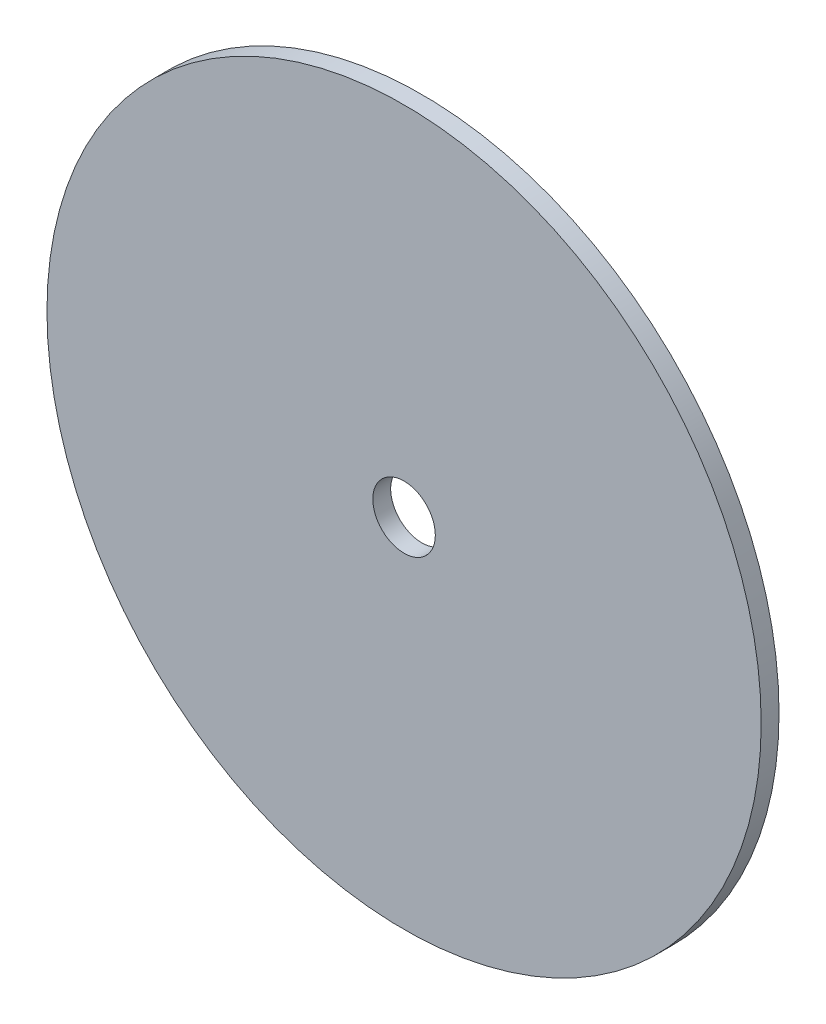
from build123d import *

# Parameters (mm, degrees)
CROQUIS1_R              = 20
CROQUIS1_R_2            = 1.75
SALIENTE_EXTRUIR1_DEPTH = 1


with BuildPart() as part:
    # Croquis1 → Saliente-Extruir1 (new body)
    with BuildSketch(Plane.XY):
        Circle(CROQUIS1_R)
        Circle(CROQUIS1_R_2, mode=Mode.SUBTRACT)
    extrude(amount=SALIENTE_EXTRUIR1_DEPTH)


solid = part.part
